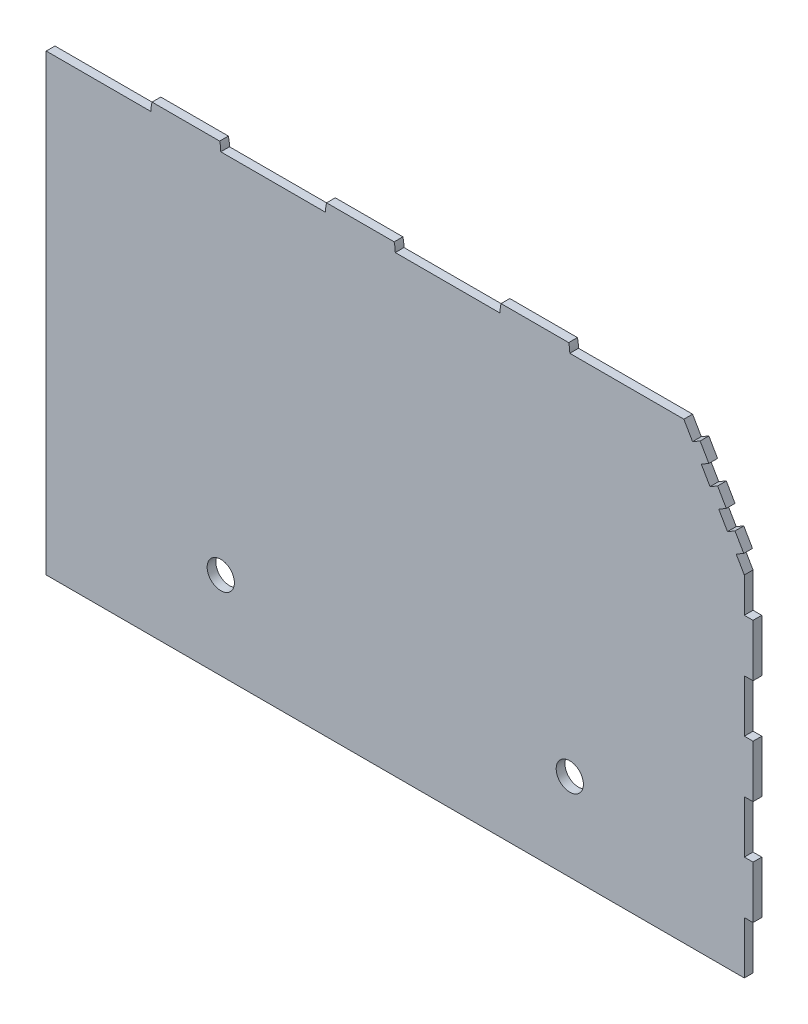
from build123d import *

# Parameters (mm, degrees)
SKETCH1_R           = 4.953
BOSS_EXTRUDE1_DEPTH = 3.175


with BuildPart() as part:
    # Sketch1 → Boss-Extrude1 (new body)
    with BuildSketch(Plane.XY):
        with BuildLine():
            Line((0, 0), (0, 165.1))
            Line((0, 165.1), (38.1, 165.1))
            ThreePointArc((38.1, 165.1), (38.201222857, 166.700254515), (38.503277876, 168.275))
            Line((38.503277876, 168.275), (63.096722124, 168.275))
            ThreePointArc((63.096722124, 168.275), (63.398777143, 166.700254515), (63.5, 165.1))
            Line((63.5, 165.1), (101.6, 165.1))
            ThreePointArc((101.6, 165.1), (101.701222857, 166.700254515), (102.003277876, 168.275))
            Line((102.003277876, 168.275), (126.596722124, 168.275))
            ThreePointArc((126.596722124, 168.275), (126.898777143, 166.700254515), (127, 165.1))
            Line((127, 165.1), (165.1, 165.1))
            ThreePointArc((165.1, 165.1), (165.201222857, 166.700254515), (165.503277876, 168.275))
            Line((165.503277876, 168.275), (190.096722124, 168.275))
            ThreePointArc((190.096722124, 168.275), (190.398777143, 166.700254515), (190.5, 165.1))
            Line((190.5, 165.1), (232.002954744, 165.1))
            Line((232.002954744, 165.1), (235.177954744, 159.600738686))
            Line((235.177954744, 159.600738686), (237.927585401, 161.188238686))
            Line((237.927585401, 161.188238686), (241.102585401, 155.688977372))
            Line((241.102585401, 155.688977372), (238.352954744, 154.101477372))
            Line((238.352954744, 154.101477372), (241.527954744, 148.602216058))
            Line((241.527954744, 148.602216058), (244.277585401, 150.189716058))
            Line((244.277585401, 150.189716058), (247.452585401, 144.690454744))
            Line((247.452585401, 144.690454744), (244.702954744, 143.102954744))
            Line((244.702954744, 143.102954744), (247.877954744, 137.60369343))
            Line((247.877954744, 137.60369343), (250.627585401, 139.19119343))
            Line((250.627585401, 139.19119343), (253.802585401, 133.691932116))
            Line((253.802585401, 133.691932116), (251.052954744, 132.104432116))
            Line((251.052954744, 132.104432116), (254, 127))
            Line((254, 127), (254, 114.3))
            Line((254, 114.3), (257.175, 114.3))
            Line((257.175, 114.3), (257.175, 95.25))
            Line((257.175, 95.25), (254, 95.25))
            Line((254, 95.25), (254, 76.2))
            Line((254, 76.2), (257.175, 76.2))
            Line((257.175, 76.2), (257.175, 57.15))
            Line((257.175, 57.15), (254, 57.15))
            Line((254, 57.15), (254, 38.1))
            Line((254, 38.1), (257.175, 38.1))
            Line((257.175, 38.1), (257.175, 19.05))
            Line((257.175, 19.05), (254, 19.05))
            Line((254, 19.05), (254, 0))
            Line((254, 0), (0, 0))
        make_face()
        with Locations((63.5, 31.75)):
            Circle(SKETCH1_R, mode=Mode.SUBTRACT)
        with Locations((190.5, 31.75)):
            Circle(SKETCH1_R, mode=Mode.SUBTRACT)
    extrude(amount=BOSS_EXTRUDE1_DEPTH)


solid = part.part
